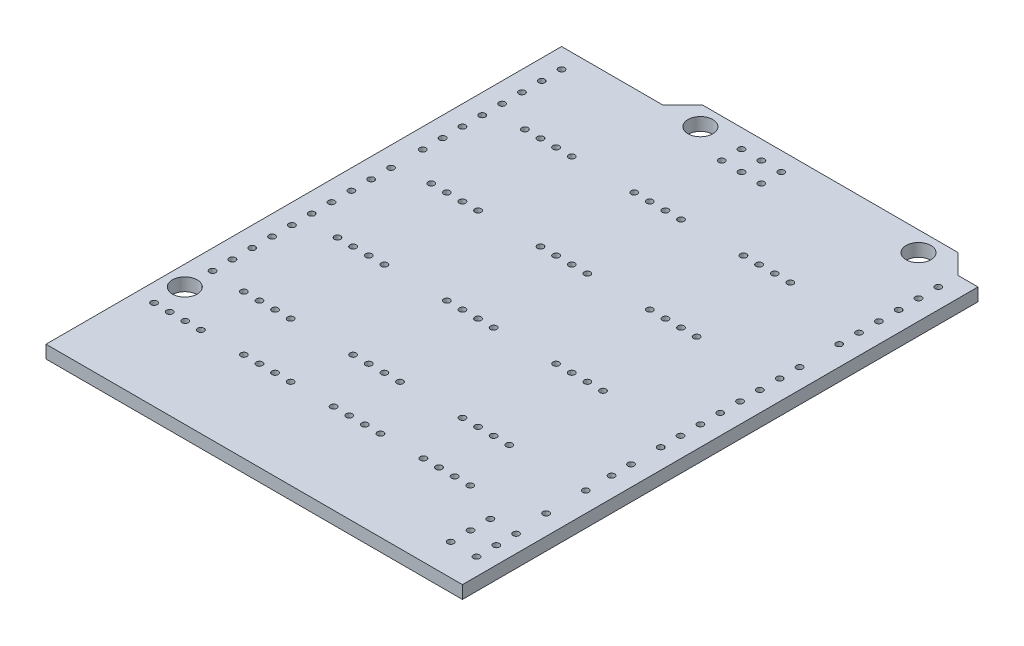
from build123d import *

# Parameters (mm, degrees)
SKETCH1_R                             = 1.5875
BOSS_EXTRUDE1_DEPTH                   = 1.65
SKETCH2_R                             = 0.4
CUT_EXTRUDE1_DEPTH                    = 1.65
SKETCH3_R                             = 0.4
CUT_EXTRUDE2_DEPTH                    = 1.65
LPATTERN1_COUNT                       = 15
LPATTERN1_PITCH                       = 2.54
SKETCH4_R                             = 0.4
CUT_EXTRUDE3_DEPTH                    = 1.65
LPATTERN2_COUNT                       = 10
LPATTERN2_PITCH                       = 2.54
LPATTERN3_COUNT                       = 8
LPATTERN3_PITCH                       = 2.54
SKETCH5_R                             = 0.4
CUT_EXTRUDE4_DEPTH                    = 10
ESQUISSE1_R                           = 0.4
ENL_V_MAT_EXTRU_1_DEPTH               = 10
R_P_TITION_LIN_AIRE1_COUNT            = 4
R_P_TITION_LIN_AIRE1_PITCH            = 2
R_P_TITION_LIN_AIRE1_COUNT_DIR2       = 4
R_P_TITION_LIN_AIRE1_PITCH_DIR2       = 11.5
ESQUISSE2_R                           = 0.4
ENL_V_MAT_EXTRU_2_DEPTH               = 10
R_P_TITION_LIN_AIRE2_COUNT            = 4
R_P_TITION_LIN_AIRE2_PITCH            = 2
R_P_TITION_LIN_AIRE2_COUNT_DIR2       = 3
R_P_TITION_LIN_AIRE2_PITCH_DIR2       = 14
R_P_TITION_LIN_AIRE3_COUNT            = 4
R_P_TITION_LIN_AIRE3_PITCH            = 12
R_P_TITION_LIN_AIRE3_COPY_1_SKETCH_R  = 0.4
R_P_TITION_LIN_AIRE3_COPY_1_DEPTH     = 10
R_P_TITION_LIN_AIRE3_COPY_2_SKETCH_R  = 0.4
R_P_TITION_LIN_AIRE3_COPY_2_DEPTH     = 10
R_P_TITION_LIN_AIRE3_COPY_3_SKETCH_R  = 0.4
R_P_TITION_LIN_AIRE3_COPY_3_DEPTH     = 10
R_P_TITION_LIN_AIRE3_COPY_4_SKETCH_R  = 0.4
R_P_TITION_LIN_AIRE3_COPY_4_DEPTH     = 10
R_P_TITION_LIN_AIRE3_COPY_5_SKETCH_R  = 0.4
R_P_TITION_LIN_AIRE3_COPY_5_DEPTH     = 10
R_P_TITION_LIN_AIRE3_COPY_6_SKETCH_R  = 0.4
R_P_TITION_LIN_AIRE3_COPY_6_DEPTH     = 10
R_P_TITION_LIN_AIRE3_COPY_7_SKETCH_R  = 0.4
R_P_TITION_LIN_AIRE3_COPY_7_DEPTH     = 10
R_P_TITION_LIN_AIRE3_COPY_8_SKETCH_R  = 0.4
R_P_TITION_LIN_AIRE3_COPY_8_DEPTH     = 10
R_P_TITION_LIN_AIRE3_COPY_9_SKETCH_R  = 0.4
R_P_TITION_LIN_AIRE3_COPY_9_DEPTH     = 10
R_P_TITION_LIN_AIRE3_COPY_10_SKETCH_R = 0.4
R_P_TITION_LIN_AIRE3_COPY_10_DEPTH    = 10
R_P_TITION_LIN_AIRE3_COPY_11_SKETCH_R = 0.4
R_P_TITION_LIN_AIRE3_COPY_11_DEPTH    = 10
R_P_TITION_LIN_AIRE3_COPY_12_SKETCH_R = 0.4
R_P_TITION_LIN_AIRE3_COPY_12_DEPTH    = 10
R_P_TITION_LIN_AIRE3_COPY_13_SKETCH_R = 0.4
R_P_TITION_LIN_AIRE3_COPY_13_DEPTH    = 10
R_P_TITION_LIN_AIRE3_COPY_14_SKETCH_R = 0.4
R_P_TITION_LIN_AIRE3_COPY_14_DEPTH    = 10
R_P_TITION_LIN_AIRE3_COPY_15_SKETCH_R = 0.4
R_P_TITION_LIN_AIRE3_COPY_15_DEPTH    = 10
R_P_TITION_LIN_AIRE3_COPY_16_SKETCH_R = 0.4
R_P_TITION_LIN_AIRE3_COPY_16_DEPTH    = 10
R_P_TITION_LIN_AIRE3_COPY_17_SKETCH_R = 0.4
R_P_TITION_LIN_AIRE3_COPY_17_DEPTH    = 10
R_P_TITION_LIN_AIRE3_COPY_18_SKETCH_R = 0.4
R_P_TITION_LIN_AIRE3_COPY_18_DEPTH    = 10
R_P_TITION_LIN_AIRE3_COPY_19_SKETCH_R = 0.4
R_P_TITION_LIN_AIRE3_COPY_19_DEPTH    = 10
R_P_TITION_LIN_AIRE3_COPY_20_SKETCH_R = 0.4
R_P_TITION_LIN_AIRE3_COPY_20_DEPTH    = 10
R_P_TITION_LIN_AIRE3_COPY_21_SKETCH_R = 0.4
R_P_TITION_LIN_AIRE3_COPY_21_DEPTH    = 10
R_P_TITION_LIN_AIRE3_COPY_22_SKETCH_R = 0.4
R_P_TITION_LIN_AIRE3_COPY_22_DEPTH    = 10
R_P_TITION_LIN_AIRE3_COPY_23_SKETCH_R = 0.4
R_P_TITION_LIN_AIRE3_COPY_23_DEPTH    = 10
R_P_TITION_LIN_AIRE3_COPY_24_SKETCH_R = 0.4
R_P_TITION_LIN_AIRE3_COPY_24_DEPTH    = 10
R_P_TITION_LIN_AIRE3_COPY_25_SKETCH_R = 0.4
R_P_TITION_LIN_AIRE3_COPY_25_DEPTH    = 10
R_P_TITION_LIN_AIRE3_COPY_26_SKETCH_R = 0.4
R_P_TITION_LIN_AIRE3_COPY_26_DEPTH    = 10
R_P_TITION_LIN_AIRE3_COPY_27_SKETCH_R = 0.4
R_P_TITION_LIN_AIRE3_COPY_27_DEPTH    = 10
R_P_TITION_LIN_AIRE3_COPY_28_SKETCH_R = 0.4
R_P_TITION_LIN_AIRE3_COPY_28_DEPTH    = 10
R_P_TITION_LIN_AIRE3_COPY_29_SKETCH_R = 0.4
R_P_TITION_LIN_AIRE3_COPY_29_DEPTH    = 10
R_P_TITION_LIN_AIRE3_COPY_30_SKETCH_R = 0.4
R_P_TITION_LIN_AIRE3_COPY_30_DEPTH    = 10
R_P_TITION_LIN_AIRE3_COPY_31_SKETCH_R = 0.4
R_P_TITION_LIN_AIRE3_COPY_31_DEPTH    = 10
R_P_TITION_LIN_AIRE3_COPY_32_SKETCH_R = 0.4
R_P_TITION_LIN_AIRE3_COPY_32_DEPTH    = 10
R_P_TITION_LIN_AIRE3_COPY_33_SKETCH_R = 0.4
R_P_TITION_LIN_AIRE3_COPY_33_DEPTH    = 10


with BuildPart() as part:
    # Sketch1 → Boss-Extrude1 (new body)
    with BuildSketch(Plane(origin=(0, 0, 0), x_dir=(1, 0, 0), z_dir=(0, 1, 0))):
        Polygon((0, 0), (-53.34, 0), (-53.34, 66.04), (-40.386, 66.04), (-37.846, 68.58), (-5.08, 68.58), (-2.54, 66.04), (0, 66.04), align=None)
        with Locations(Location((-7.62, 66.04, 0), (0, 0, 270))):
            Circle(SKETCH1_R, mode=Mode.SUBTRACT)
        with Locations(Location((-35.56, 66.04, 0), (0, 0, 270))):
            Circle(SKETCH1_R, mode=Mode.SUBTRACT)
        with Locations(Location((-50.8, 15.24, 0), (0, 0, 270))):
            Circle(SKETCH1_R, mode=Mode.SUBTRACT)
    extrude(amount=-BOSS_EXTRUDE1_DEPTH)

    # Sketch2 → Cut-Extrude1 (cut)
    with BuildSketch(Plane(origin=(0, 0, 0), x_dir=(1, 0, 0), z_dir=(0, 1, 0))):
        with Locations(Location((-2.54, 27.94, 0), (0, 0, 270))):
            Circle(SKETCH2_R)
    cut_extrude1 = extrude(amount=-CUT_EXTRUDE1_DEPTH, mode=Mode.SUBTRACT)

    # Sketch3 → Cut-Extrude2 (cut)
    with BuildSketch(Plane(origin=(0, 0, 0), x_dir=(1, 0, 0), z_dir=(0, 1, 0))):
        with Locations(Location((-50.8, 18.796, 0), (0, 0, 270))):
            Circle(SKETCH3_R)
    cut_extrude2 = extrude(amount=-CUT_EXTRUDE2_DEPTH, mode=Mode.SUBTRACT)

    # LPattern1: Cut-Extrude1 ×15, 1 skipped
    with Locations(*[(0, 0, -i * LPATTERN1_PITCH) for i in range(1, LPATTERN1_COUNT) if i not in (8,)]):
        add(cut_extrude1, mode=Mode.SUBTRACT)

    # Sketch4 → Cut-Extrude3 (cut)
    with BuildSketch(Plane(origin=(0, 0, 0), x_dir=(1, 0, 0), z_dir=(0, 1, 0))):
        with Locations(Location((-50.8, 45.72, 0), (0, 0, 270))):
            Circle(SKETCH4_R)
    cut_extrude3 = extrude(amount=-CUT_EXTRUDE3_DEPTH, mode=Mode.SUBTRACT)

    # LPattern2: Cut-Extrude2 ×10
    with Locations(*[(0, 0, -i * LPATTERN2_PITCH) for i in range(1, LPATTERN2_COUNT)]):
        add(cut_extrude2, mode=Mode.SUBTRACT)

    # LPattern3: Cut-Extrude3 ×8
    with Locations(*[(0, 0, -i * LPATTERN3_PITCH) for i in range(1, LPATTERN3_COUNT)]):
        add(cut_extrude3, mode=Mode.SUBTRACT)

    # Sketch5 → Cut-Extrude4 (cut)
    with BuildSketch(Plane(origin=(0, 0, 0), x_dir=(1, 0, 0), z_dir=(0, 1, 0))):
        with Locations(Location((-30.43, 66.18, 0), (0, 0, 270))):
            Circle(SKETCH5_R)
        with Locations(Location((-27.89, 66.18, 0), (0, 0, 270))):
            Circle(SKETCH5_R)
        with Locations(Location((-25.35, 66.18, 0), (0, 0, 270))):
            Circle(SKETCH5_R)
        with Locations(Location((-25.35, 63.64, 0), (0, 0, 270))):
            Circle(SKETCH5_R)
        with Locations(Location((-27.89, 63.64, 0), (0, 0, 270))):
            Circle(SKETCH5_R)
        with Locations(Location((-30.43, 63.64, 0), (0, 0, 270))):
            Circle(SKETCH5_R)
        with Locations(Location((-5.5, 4, 0), (0, 0, 270))):
            Circle(SKETCH5_R)
        with Locations(Location((-5.5, 6.54, 0), (0, 0, 270))):
            Circle(SKETCH5_R)
        with Locations(Location((-5.5, 9.08, 0), (0, 0, 270))):
            Circle(SKETCH5_R)
        with Locations(Location((-2.2, 9.08, 0), (0, 0, 270))):
            Circle(SKETCH5_R)
        with Locations(Location((-2.2, 6.54, 0), (0, 0, 270))):
            Circle(SKETCH5_R)
        with Locations(Location((-2.2, 4, 0), (0, 0, 270))):
            Circle(SKETCH5_R)
        with Locations(Location((-2.54, 24.14, 0), (0, 0, 270))):
            Circle(SKETCH5_R)
        with Locations(Location((-2.54, 21.64, 0), (0, 0, 270))):
            Circle(SKETCH5_R)
        with Locations(Location((-2.54, 18.34, 0), (0, 0, 270))):
            Circle(SKETCH5_R)
        with Locations(Location((-2.54, 13.26, 0), (0, 0, 270))):
            Circle(SKETCH5_R)
    extrude(amount=-CUT_EXTRUDE4_DEPTH, mode=Mode.SUBTRACT)

    # Esquisse1 → Enl_v. mat.-Extru.1 (cut)
    with BuildSketch(Plane.XZ.offset(1.65)):
        with Locations(Location((-10.5, -11.5, 0), (0, 0, 270))):
            Circle(ESQUISSE1_R)
    enl_v_mat_extru_1 = extrude(amount=-ENL_V_MAT_EXTRU_1_DEPTH, mode=Mode.SUBTRACT)

    # R_p_tition lin_aire1: Enl_v. mat.-Extru.1 4 × 4
    with Locations(*[Vector(-1, 0, 0) * (i * R_P_TITION_LIN_AIRE1_PITCH) + Vector(-1, 0, 0) * (j * R_P_TITION_LIN_AIRE1_PITCH_DIR2) for i in range(R_P_TITION_LIN_AIRE1_COUNT) for j in range(R_P_TITION_LIN_AIRE1_COUNT_DIR2) if (i, j) != (0, 0)]):
        add(enl_v_mat_extru_1, mode=Mode.SUBTRACT)

    # Esquisse2 → Enl_v. mat.-Extru.2 (cut)
    with BuildSketch(Plane.XZ.offset(1.65)):
        with Locations(Location((-12.5, -18.5, 0), (0, 0, 270))):
            Circle(ESQUISSE2_R)
    enl_v_mat_extru_2 = extrude(amount=-ENL_V_MAT_EXTRU_2_DEPTH, mode=Mode.SUBTRACT)

    # R_p_tition lin_aire2: Enl_v. mat.-Extru.2 4 × 3
    with Locations(*[Vector(-1, 0, 0) * (i * R_P_TITION_LIN_AIRE2_PITCH) + Vector(-1, 0, 0) * (j * R_P_TITION_LIN_AIRE2_PITCH_DIR2) for i in range(R_P_TITION_LIN_AIRE2_COUNT) for j in range(R_P_TITION_LIN_AIRE2_COUNT_DIR2) if (i, j) != (0, 0)]):
        add(enl_v_mat_extru_2, mode=Mode.SUBTRACT)

    # R_p_tition lin_aire3: Enl_v. mat.-Extru.2 ×4
    with Locations(*[(0, 0, -i * R_P_TITION_LIN_AIRE3_PITCH) for i in range(1, R_P_TITION_LIN_AIRE3_COUNT)]):
        add(enl_v_mat_extru_2, mode=Mode.SUBTRACT)

    # R_p_tition lin_aire3 copy 1 sketch → R_p_tition lin_aire3 copy 1 (cut)
    with BuildSketch(Plane(origin=(-14, -1.65, -12), x_dir=(1, 0, 0), z_dir=(0, -1, 0))):
        with Locations(Location((-12.5, -18.5, 0), (0, 0, 270))):
            Circle(R_P_TITION_LIN_AIRE3_COPY_1_SKETCH_R)
    extrude(amount=-R_P_TITION_LIN_AIRE3_COPY_1_DEPTH, mode=Mode.SUBTRACT)

    # R_p_tition lin_aire3 copy 2 sketch → R_p_tition lin_aire3 copy 2 (cut)
    with BuildSketch(Plane(origin=(-14, -1.65, -24), x_dir=(1, 0, 0), z_dir=(0, -1, 0))):
        with Locations(Location((-12.5, -18.5, 0), (0, 0, 270))):
            Circle(R_P_TITION_LIN_AIRE3_COPY_2_SKETCH_R)
    extrude(amount=-R_P_TITION_LIN_AIRE3_COPY_2_DEPTH, mode=Mode.SUBTRACT)

    # R_p_tition lin_aire3 copy 3 sketch → R_p_tition lin_aire3 copy 3 (cut)
    with BuildSketch(Plane(origin=(-14, -1.65, -36), x_dir=(1, 0, 0), z_dir=(0, -1, 0))):
        with Locations(Location((-12.5, -18.5, 0), (0, 0, 270))):
            Circle(R_P_TITION_LIN_AIRE3_COPY_3_SKETCH_R)
    extrude(amount=-R_P_TITION_LIN_AIRE3_COPY_3_DEPTH, mode=Mode.SUBTRACT)

    # R_p_tition lin_aire3 copy 4 sketch → R_p_tition lin_aire3 copy 4 (cut)
    with BuildSketch(Plane(origin=(-28, -1.65, -12), x_dir=(1, 0, 0), z_dir=(0, -1, 0))):
        with Locations(Location((-12.5, -18.5, 0), (0, 0, 270))):
            Circle(R_P_TITION_LIN_AIRE3_COPY_4_SKETCH_R)
    extrude(amount=-R_P_TITION_LIN_AIRE3_COPY_4_DEPTH, mode=Mode.SUBTRACT)

    # R_p_tition lin_aire3 copy 5 sketch → R_p_tition lin_aire3 copy 5 (cut)
    with BuildSketch(Plane(origin=(-28, -1.65, -24), x_dir=(1, 0, 0), z_dir=(0, -1, 0))):
        with Locations(Location((-12.5, -18.5, 0), (0, 0, 270))):
            Circle(R_P_TITION_LIN_AIRE3_COPY_5_SKETCH_R)
    extrude(amount=-R_P_TITION_LIN_AIRE3_COPY_5_DEPTH, mode=Mode.SUBTRACT)

    # R_p_tition lin_aire3 copy 6 sketch → R_p_tition lin_aire3 copy 6 (cut)
    with BuildSketch(Plane(origin=(-28, -1.65, -36), x_dir=(1, 0, 0), z_dir=(0, -1, 0))):
        with Locations(Location((-12.5, -18.5, 0), (0, 0, 270))):
            Circle(R_P_TITION_LIN_AIRE3_COPY_6_SKETCH_R)
    extrude(amount=-R_P_TITION_LIN_AIRE3_COPY_6_DEPTH, mode=Mode.SUBTRACT)

    # R_p_tition lin_aire3 copy 7 sketch → R_p_tition lin_aire3 copy 7 (cut)
    with BuildSketch(Plane(origin=(-2, -1.65, -12), x_dir=(1, 0, 0), z_dir=(0, -1, 0))):
        with Locations(Location((-12.5, -18.5, 0), (0, 0, 270))):
            Circle(R_P_TITION_LIN_AIRE3_COPY_7_SKETCH_R)
    extrude(amount=-R_P_TITION_LIN_AIRE3_COPY_7_DEPTH, mode=Mode.SUBTRACT)

    # R_p_tition lin_aire3 copy 8 sketch → R_p_tition lin_aire3 copy 8 (cut)
    with BuildSketch(Plane(origin=(-2, -1.65, -24), x_dir=(1, 0, 0), z_dir=(0, -1, 0))):
        with Locations(Location((-12.5, -18.5, 0), (0, 0, 270))):
            Circle(R_P_TITION_LIN_AIRE3_COPY_8_SKETCH_R)
    extrude(amount=-R_P_TITION_LIN_AIRE3_COPY_8_DEPTH, mode=Mode.SUBTRACT)

    # R_p_tition lin_aire3 copy 9 sketch → R_p_tition lin_aire3 copy 9 (cut)
    with BuildSketch(Plane(origin=(-2, -1.65, -36), x_dir=(1, 0, 0), z_dir=(0, -1, 0))):
        with Locations(Location((-12.5, -18.5, 0), (0, 0, 270))):
            Circle(R_P_TITION_LIN_AIRE3_COPY_9_SKETCH_R)
    extrude(amount=-R_P_TITION_LIN_AIRE3_COPY_9_DEPTH, mode=Mode.SUBTRACT)

    # R_p_tition lin_aire3 copy 10 sketch → R_p_tition lin_aire3 copy 10 (cut)
    with BuildSketch(Plane(origin=(-16, -1.65, -12), x_dir=(1, 0, 0), z_dir=(0, -1, 0))):
        with Locations(Location((-12.5, -18.5, 0), (0, 0, 270))):
            Circle(R_P_TITION_LIN_AIRE3_COPY_10_SKETCH_R)
    extrude(amount=-R_P_TITION_LIN_AIRE3_COPY_10_DEPTH, mode=Mode.SUBTRACT)

    # R_p_tition lin_aire3 copy 11 sketch → R_p_tition lin_aire3 copy 11 (cut)
    with BuildSketch(Plane(origin=(-16, -1.65, -24), x_dir=(1, 0, 0), z_dir=(0, -1, 0))):
        with Locations(Location((-12.5, -18.5, 0), (0, 0, 270))):
            Circle(R_P_TITION_LIN_AIRE3_COPY_11_SKETCH_R)
    extrude(amount=-R_P_TITION_LIN_AIRE3_COPY_11_DEPTH, mode=Mode.SUBTRACT)

    # R_p_tition lin_aire3 copy 12 sketch → R_p_tition lin_aire3 copy 12 (cut)
    with BuildSketch(Plane(origin=(-16, -1.65, -36), x_dir=(1, 0, 0), z_dir=(0, -1, 0))):
        with Locations(Location((-12.5, -18.5, 0), (0, 0, 270))):
            Circle(R_P_TITION_LIN_AIRE3_COPY_12_SKETCH_R)
    extrude(amount=-R_P_TITION_LIN_AIRE3_COPY_12_DEPTH, mode=Mode.SUBTRACT)

    # R_p_tition lin_aire3 copy 13 sketch → R_p_tition lin_aire3 copy 13 (cut)
    with BuildSketch(Plane(origin=(-30, -1.65, -12), x_dir=(1, 0, 0), z_dir=(0, -1, 0))):
        with Locations(Location((-12.5, -18.5, 0), (0, 0, 270))):
            Circle(R_P_TITION_LIN_AIRE3_COPY_13_SKETCH_R)
    extrude(amount=-R_P_TITION_LIN_AIRE3_COPY_13_DEPTH, mode=Mode.SUBTRACT)

    # R_p_tition lin_aire3 copy 14 sketch → R_p_tition lin_aire3 copy 14 (cut)
    with BuildSketch(Plane(origin=(-30, -1.65, -24), x_dir=(1, 0, 0), z_dir=(0, -1, 0))):
        with Locations(Location((-12.5, -18.5, 0), (0, 0, 270))):
            Circle(R_P_TITION_LIN_AIRE3_COPY_14_SKETCH_R)
    extrude(amount=-R_P_TITION_LIN_AIRE3_COPY_14_DEPTH, mode=Mode.SUBTRACT)

    # R_p_tition lin_aire3 copy 15 sketch → R_p_tition lin_aire3 copy 15 (cut)
    with BuildSketch(Plane(origin=(-30, -1.65, -36), x_dir=(1, 0, 0), z_dir=(0, -1, 0))):
        with Locations(Location((-12.5, -18.5, 0), (0, 0, 270))):
            Circle(R_P_TITION_LIN_AIRE3_COPY_15_SKETCH_R)
    extrude(amount=-R_P_TITION_LIN_AIRE3_COPY_15_DEPTH, mode=Mode.SUBTRACT)

    # R_p_tition lin_aire3 copy 16 sketch → R_p_tition lin_aire3 copy 16 (cut)
    with BuildSketch(Plane(origin=(-4, -1.65, -12), x_dir=(1, 0, 0), z_dir=(0, -1, 0))):
        with Locations(Location((-12.5, -18.5, 0), (0, 0, 270))):
            Circle(R_P_TITION_LIN_AIRE3_COPY_16_SKETCH_R)
    extrude(amount=-R_P_TITION_LIN_AIRE3_COPY_16_DEPTH, mode=Mode.SUBTRACT)

    # R_p_tition lin_aire3 copy 17 sketch → R_p_tition lin_aire3 copy 17 (cut)
    with BuildSketch(Plane(origin=(-4, -1.65, -24), x_dir=(1, 0, 0), z_dir=(0, -1, 0))):
        with Locations(Location((-12.5, -18.5, 0), (0, 0, 270))):
            Circle(R_P_TITION_LIN_AIRE3_COPY_17_SKETCH_R)
    extrude(amount=-R_P_TITION_LIN_AIRE3_COPY_17_DEPTH, mode=Mode.SUBTRACT)

    # R_p_tition lin_aire3 copy 18 sketch → R_p_tition lin_aire3 copy 18 (cut)
    with BuildSketch(Plane(origin=(-4, -1.65, -36), x_dir=(1, 0, 0), z_dir=(0, -1, 0))):
        with Locations(Location((-12.5, -18.5, 0), (0, 0, 270))):
            Circle(R_P_TITION_LIN_AIRE3_COPY_18_SKETCH_R)
    extrude(amount=-R_P_TITION_LIN_AIRE3_COPY_18_DEPTH, mode=Mode.SUBTRACT)

    # R_p_tition lin_aire3 copy 19 sketch → R_p_tition lin_aire3 copy 19 (cut)
    with BuildSketch(Plane(origin=(-18, -1.65, -12), x_dir=(1, 0, 0), z_dir=(0, -1, 0))):
        with Locations(Location((-12.5, -18.5, 0), (0, 0, 270))):
            Circle(R_P_TITION_LIN_AIRE3_COPY_19_SKETCH_R)
    extrude(amount=-R_P_TITION_LIN_AIRE3_COPY_19_DEPTH, mode=Mode.SUBTRACT)

    # R_p_tition lin_aire3 copy 20 sketch → R_p_tition lin_aire3 copy 20 (cut)
    with BuildSketch(Plane(origin=(-18, -1.65, -24), x_dir=(1, 0, 0), z_dir=(0, -1, 0))):
        with Locations(Location((-12.5, -18.5, 0), (0, 0, 270))):
            Circle(R_P_TITION_LIN_AIRE3_COPY_20_SKETCH_R)
    extrude(amount=-R_P_TITION_LIN_AIRE3_COPY_20_DEPTH, mode=Mode.SUBTRACT)

    # R_p_tition lin_aire3 copy 21 sketch → R_p_tition lin_aire3 copy 21 (cut)
    with BuildSketch(Plane(origin=(-18, -1.65, -36), x_dir=(1, 0, 0), z_dir=(0, -1, 0))):
        with Locations(Location((-12.5, -18.5, 0), (0, 0, 270))):
            Circle(R_P_TITION_LIN_AIRE3_COPY_21_SKETCH_R)
    extrude(amount=-R_P_TITION_LIN_AIRE3_COPY_21_DEPTH, mode=Mode.SUBTRACT)

    # R_p_tition lin_aire3 copy 22 sketch → R_p_tition lin_aire3 copy 22 (cut)
    with BuildSketch(Plane(origin=(-32, -1.65, -12), x_dir=(1, 0, 0), z_dir=(0, -1, 0))):
        with Locations(Location((-12.5, -18.5, 0), (0, 0, 270))):
            Circle(R_P_TITION_LIN_AIRE3_COPY_22_SKETCH_R)
    extrude(amount=-R_P_TITION_LIN_AIRE3_COPY_22_DEPTH, mode=Mode.SUBTRACT)

    # R_p_tition lin_aire3 copy 23 sketch → R_p_tition lin_aire3 copy 23 (cut)
    with BuildSketch(Plane(origin=(-32, -1.65, -24), x_dir=(1, 0, 0), z_dir=(0, -1, 0))):
        with Locations(Location((-12.5, -18.5, 0), (0, 0, 270))):
            Circle(R_P_TITION_LIN_AIRE3_COPY_23_SKETCH_R)
    extrude(amount=-R_P_TITION_LIN_AIRE3_COPY_23_DEPTH, mode=Mode.SUBTRACT)

    # R_p_tition lin_aire3 copy 24 sketch → R_p_tition lin_aire3 copy 24 (cut)
    with BuildSketch(Plane(origin=(-32, -1.65, -36), x_dir=(1, 0, 0), z_dir=(0, -1, 0))):
        with Locations(Location((-12.5, -18.5, 0), (0, 0, 270))):
            Circle(R_P_TITION_LIN_AIRE3_COPY_24_SKETCH_R)
    extrude(amount=-R_P_TITION_LIN_AIRE3_COPY_24_DEPTH, mode=Mode.SUBTRACT)

    # R_p_tition lin_aire3 copy 25 sketch → R_p_tition lin_aire3 copy 25 (cut)
    with BuildSketch(Plane(origin=(-6, -1.65, -12), x_dir=(1, 0, 0), z_dir=(0, -1, 0))):
        with Locations(Location((-12.5, -18.5, 0), (0, 0, 270))):
            Circle(R_P_TITION_LIN_AIRE3_COPY_25_SKETCH_R)
    extrude(amount=-R_P_TITION_LIN_AIRE3_COPY_25_DEPTH, mode=Mode.SUBTRACT)

    # R_p_tition lin_aire3 copy 26 sketch → R_p_tition lin_aire3 copy 26 (cut)
    with BuildSketch(Plane(origin=(-6, -1.65, -24), x_dir=(1, 0, 0), z_dir=(0, -1, 0))):
        with Locations(Location((-12.5, -18.5, 0), (0, 0, 270))):
            Circle(R_P_TITION_LIN_AIRE3_COPY_26_SKETCH_R)
    extrude(amount=-R_P_TITION_LIN_AIRE3_COPY_26_DEPTH, mode=Mode.SUBTRACT)

    # R_p_tition lin_aire3 copy 27 sketch → R_p_tition lin_aire3 copy 27 (cut)
    with BuildSketch(Plane(origin=(-6, -1.65, -36), x_dir=(1, 0, 0), z_dir=(0, -1, 0))):
        with Locations(Location((-12.5, -18.5, 0), (0, 0, 270))):
            Circle(R_P_TITION_LIN_AIRE3_COPY_27_SKETCH_R)
    extrude(amount=-R_P_TITION_LIN_AIRE3_COPY_27_DEPTH, mode=Mode.SUBTRACT)

    # R_p_tition lin_aire3 copy 28 sketch → R_p_tition lin_aire3 copy 28 (cut)
    with BuildSketch(Plane(origin=(-20, -1.65, -12), x_dir=(1, 0, 0), z_dir=(0, -1, 0))):
        with Locations(Location((-12.5, -18.5, 0), (0, 0, 270))):
            Circle(R_P_TITION_LIN_AIRE3_COPY_28_SKETCH_R)
    extrude(amount=-R_P_TITION_LIN_AIRE3_COPY_28_DEPTH, mode=Mode.SUBTRACT)

    # R_p_tition lin_aire3 copy 29 sketch → R_p_tition lin_aire3 copy 29 (cut)
    with BuildSketch(Plane(origin=(-20, -1.65, -24), x_dir=(1, 0, 0), z_dir=(0, -1, 0))):
        with Locations(Location((-12.5, -18.5, 0), (0, 0, 270))):
            Circle(R_P_TITION_LIN_AIRE3_COPY_29_SKETCH_R)
    extrude(amount=-R_P_TITION_LIN_AIRE3_COPY_29_DEPTH, mode=Mode.SUBTRACT)

    # R_p_tition lin_aire3 copy 30 sketch → R_p_tition lin_aire3 copy 30 (cut)
    with BuildSketch(Plane(origin=(-20, -1.65, -36), x_dir=(1, 0, 0), z_dir=(0, -1, 0))):
        with Locations(Location((-12.5, -18.5, 0), (0, 0, 270))):
            Circle(R_P_TITION_LIN_AIRE3_COPY_30_SKETCH_R)
    extrude(amount=-R_P_TITION_LIN_AIRE3_COPY_30_DEPTH, mode=Mode.SUBTRACT)

    # R_p_tition lin_aire3 copy 31 sketch → R_p_tition lin_aire3 copy 31 (cut)
    with BuildSketch(Plane(origin=(-34, -1.65, -12), x_dir=(1, 0, 0), z_dir=(0, -1, 0))):
        with Locations(Location((-12.5, -18.5, 0), (0, 0, 270))):
            Circle(R_P_TITION_LIN_AIRE3_COPY_31_SKETCH_R)
    extrude(amount=-R_P_TITION_LIN_AIRE3_COPY_31_DEPTH, mode=Mode.SUBTRACT)

    # R_p_tition lin_aire3 copy 32 sketch → R_p_tition lin_aire3 copy 32 (cut)
    with BuildSketch(Plane(origin=(-34, -1.65, -24), x_dir=(1, 0, 0), z_dir=(0, -1, 0))):
        with Locations(Location((-12.5, -18.5, 0), (0, 0, 270))):
            Circle(R_P_TITION_LIN_AIRE3_COPY_32_SKETCH_R)
    extrude(amount=-R_P_TITION_LIN_AIRE3_COPY_32_DEPTH, mode=Mode.SUBTRACT)

    # R_p_tition lin_aire3 copy 33 sketch → R_p_tition lin_aire3 copy 33 (cut)
    with BuildSketch(Plane(origin=(-34, -1.65, -36), x_dir=(1, 0, 0), z_dir=(0, -1, 0))):
        with Locations(Location((-12.5, -18.5, 0), (0, 0, 270))):
            Circle(R_P_TITION_LIN_AIRE3_COPY_33_SKETCH_R)
    extrude(amount=-R_P_TITION_LIN_AIRE3_COPY_33_DEPTH, mode=Mode.SUBTRACT)


solid = part.part
